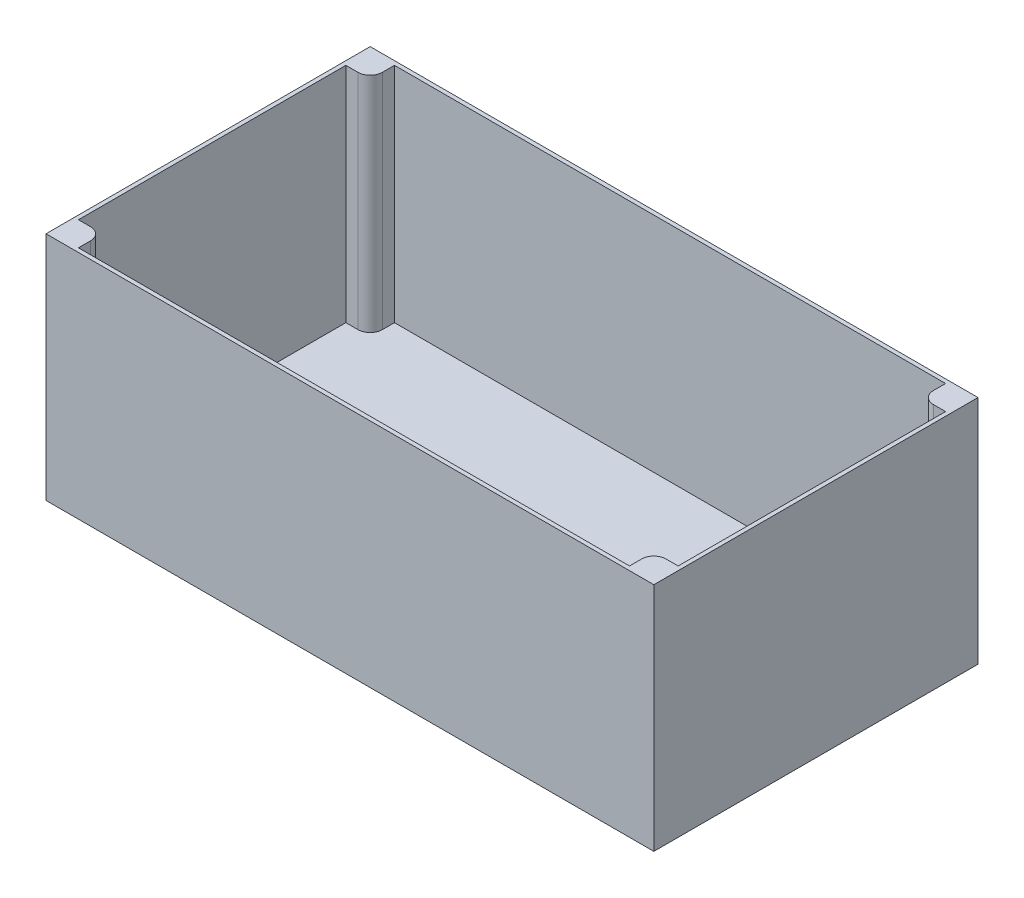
ISO-10303-21;
HEADER;
FILE_DESCRIPTION(('STEP AP214'),'2;1');
FILE_NAME('part.step','',(''),(''),'','','');
FILE_SCHEMA(('AUTOMOTIVE_DESIGN { 1 0 10303 214 1 1 1 1 }'));
ENDSEC;
DATA;
#1=APPLICATION_CONTEXT('core data for automotive mechanical design processes');
#2=APPLICATION_PROTOCOL_DEFINITION('international standard','automotive_design',2000,#1);
#3=PRODUCT_CONTEXT('',#1,'mechanical');
#4=PRODUCT('Part','Part','',(#3));
#5=PRODUCT_RELATED_PRODUCT_CATEGORY('part','',(#4));
#6=PRODUCT_DEFINITION_FORMATION('','',#4);
#7=PRODUCT_DEFINITION_CONTEXT('part definition',#1,'design');
#8=PRODUCT_DEFINITION('design','',#6,#7);
#9=PRODUCT_DEFINITION_SHAPE('','',#8);
#10=(LENGTH_UNIT() NAMED_UNIT(*) SI_UNIT(.MILLI.,.METRE.));
#11=(NAMED_UNIT(*) PLANE_ANGLE_UNIT() SI_UNIT($,.RADIAN.));
#12=(NAMED_UNIT(*) SI_UNIT($,.STERADIAN.) SOLID_ANGLE_UNIT());
#13=UNCERTAINTY_MEASURE_WITH_UNIT(LENGTH_MEASURE(1.E-05),#10,'distance_accuracy_value','');
#14=(GEOMETRIC_REPRESENTATION_CONTEXT(3) GLOBAL_UNCERTAINTY_ASSIGNED_CONTEXT((#13)) GLOBAL_UNIT_ASSIGNED_CONTEXT((#10,
#11,#12)) REPRESENTATION_CONTEXT('',''));
#15=CARTESIAN_POINT('',(0.,0.,0.));
#16=DIRECTION('',(0.,0.,1.));
#17=DIRECTION('',(1.,0.,0.));
#18=AXIS2_PLACEMENT_3D('',#15,#16,#17);
#19=CARTESIAN_POINT('',(0.,2.,0.));
#20=DIRECTION('',(0.,-1.,0.));
#21=DIRECTION('',(0.,0.,-1.));
#22=AXIS2_PLACEMENT_3D('',#19,#20,#21);
#23=PLANE('',#22);
#24=DIRECTION('',(-1.,0.,0.));
#25=VECTOR('',#24,1.);
#26=CARTESIAN_POINT('',(68.,2.,33.));
#27=LINE('',#26,#25);
#28=CARTESIAN_POINT('',(74.,2.,33.));
#29=VERTEX_POINT('',#28);
#30=CARTESIAN_POINT('',(71.,2.,33.));
#31=VERTEX_POINT('',#30);
#32=EDGE_CURVE('E581',#29,#31,#27,.T.);
#33=ORIENTED_EDGE('',*,*,#32,.F.);
#34=DIRECTION('',(0.,0.,-1.));
#35=VECTOR('',#34,1.);
#36=CARTESIAN_POINT('',(74.,2.,39.));
#37=LINE('',#36,#35);
#38=CARTESIAN_POINT('',(74.,2.,-33.));
#39=VERTEX_POINT('',#38);
#40=EDGE_CURVE('E214',#29,#39,#37,.T.);
#41=ORIENTED_EDGE('',*,*,#40,.T.);
#42=DIRECTION('',(1.,0.,0.));
#43=VECTOR('',#42,1.);
#44=CARTESIAN_POINT('',(74.,2.,-33.));
#45=LINE('',#44,#43);
#46=CARTESIAN_POINT('',(71.,2.,-33.));
#47=VERTEX_POINT('',#46);
#48=EDGE_CURVE('E302',#47,#39,#45,.T.);
#49=ORIENTED_EDGE('',*,*,#48,.F.);
#50=CARTESIAN_POINT('',(71.,2.,-36.));
#51=DIRECTION('',(0.,-1.,0.));
#52=DIRECTION('',(0.,0.,-1.));
#53=AXIS2_PLACEMENT_3D('',#50,#51,#52);
#54=CIRCLE('',#53,3.);
#55=CARTESIAN_POINT('',(68.,2.,-36.));
#56=VERTEX_POINT('',#55);
#57=EDGE_CURVE('E43',#47,#56,#54,.T.);
#58=ORIENTED_EDGE('',*,*,#57,.T.);
#59=DIRECTION('',(0.,0.,1.));
#60=VECTOR('',#59,1.);
#61=CARTESIAN_POINT('',(68.,2.,-39.));
#62=LINE('',#61,#60);
#63=CARTESIAN_POINT('',(68.,2.,-39.));
#64=VERTEX_POINT('',#63);
#65=EDGE_CURVE('E300',#64,#56,#62,.T.);
#66=ORIENTED_EDGE('',*,*,#65,.F.);
#67=DIRECTION('',(-1.,0.,0.));
#68=VECTOR('',#67,1.);
#69=CARTESIAN_POINT('',(-74.,2.,-39.));
#70=LINE('',#69,#68);
#71=CARTESIAN_POINT('',(-68.,2.,-39.));
#72=VERTEX_POINT('',#71);
#73=EDGE_CURVE('E230',#64,#72,#70,.T.);
#74=ORIENTED_EDGE('',*,*,#73,.T.);
#75=DIRECTION('',(0.,0.,-1.));
#76=VECTOR('',#75,1.);
#77=CARTESIAN_POINT('',(-68.,2.,-39.));
#78=LINE('',#77,#76);
#79=CARTESIAN_POINT('',(-68.,2.,-36.));
#80=VERTEX_POINT('',#79);
#81=EDGE_CURVE('E216',#80,#72,#78,.T.);
#82=ORIENTED_EDGE('',*,*,#81,.F.);
#83=CARTESIAN_POINT('',(-71.,2.,-36.));
#84=DIRECTION('',(0.,-1.,0.));
#85=DIRECTION('',(0.,0.,-1.));
#86=AXIS2_PLACEMENT_3D('',#83,#84,#85);
#87=CIRCLE('',#86,3.);
#88=CARTESIAN_POINT('',(-71.,2.,-33.));
#89=VERTEX_POINT('',#88);
#90=EDGE_CURVE('E11',#80,#89,#87,.T.);
#91=ORIENTED_EDGE('',*,*,#90,.T.);
#92=DIRECTION('',(1.,0.,0.));
#93=VECTOR('',#92,1.);
#94=CARTESIAN_POINT('',(-74.,2.,-33.));
#95=LINE('',#94,#93);
#96=CARTESIAN_POINT('',(-74.,2.,-33.));
#97=VERTEX_POINT('',#96);
#98=EDGE_CURVE('E180',#97,#89,#95,.T.);
#99=ORIENTED_EDGE('',*,*,#98,.F.);
#100=DIRECTION('',(0.,0.,1.));
#101=VECTOR('',#100,1.);
#102=CARTESIAN_POINT('',(-74.,2.,39.));
#103=LINE('',#102,#101);
#104=CARTESIAN_POINT('',(-74.,2.,33.));
#105=VERTEX_POINT('',#104);
#106=EDGE_CURVE('E233',#97,#105,#103,.T.);
#107=ORIENTED_EDGE('',*,*,#106,.T.);
#108=DIRECTION('',(-1.,0.,0.));
#109=VECTOR('',#108,1.);
#110=CARTESIAN_POINT('',(-74.,2.,33.));
#111=LINE('',#110,#109);
#112=CARTESIAN_POINT('',(-71.,2.,33.));
#113=VERTEX_POINT('',#112);
#114=EDGE_CURVE('E204',#113,#105,#111,.T.);
#115=ORIENTED_EDGE('',*,*,#114,.F.);
#116=CARTESIAN_POINT('',(-71.,2.,36.));
#117=DIRECTION('',(0.,-1.,0.));
#118=DIRECTION('',(0.,0.,-1.));
#119=AXIS2_PLACEMENT_3D('',#116,#117,#118);
#120=CIRCLE('',#119,3.);
#121=CARTESIAN_POINT('',(-68.,2.,36.));
#122=VERTEX_POINT('',#121);
#123=EDGE_CURVE('E295',#113,#122,#120,.T.);
#124=ORIENTED_EDGE('',*,*,#123,.T.);
#125=DIRECTION('',(0.,0.,-1.));
#126=VECTOR('',#125,1.);
#127=CARTESIAN_POINT('',(-68.,2.,39.));
#128=LINE('',#127,#126);
#129=CARTESIAN_POINT('',(-68.,2.,39.));
#130=VERTEX_POINT('',#129);
#131=EDGE_CURVE('E327',#130,#122,#128,.T.);
#132=ORIENTED_EDGE('',*,*,#131,.F.);
#133=DIRECTION('',(1.,0.,0.));
#134=VECTOR('',#133,1.);
#135=CARTESIAN_POINT('',(-74.,2.,39.));
#136=LINE('',#135,#134);
#137=CARTESIAN_POINT('',(68.,2.,39.));
#138=VERTEX_POINT('',#137);
#139=EDGE_CURVE('E198',#130,#138,#136,.T.);
#140=ORIENTED_EDGE('',*,*,#139,.T.);
#141=DIRECTION('',(0.,0.,1.));
#142=VECTOR('',#141,1.);
#143=CARTESIAN_POINT('',(68.,2.,39.));
#144=LINE('',#143,#142);
#145=CARTESIAN_POINT('',(68.,2.,36.));
#146=VERTEX_POINT('',#145);
#147=EDGE_CURVE('E587',#146,#138,#144,.T.);
#148=ORIENTED_EDGE('',*,*,#147,.F.);
#149=CARTESIAN_POINT('',(71.,2.,36.));
#150=DIRECTION('',(0.,-1.,0.));
#151=DIRECTION('',(0.,0.,-1.));
#152=AXIS2_PLACEMENT_3D('',#149,#150,#151);
#153=CIRCLE('',#152,3.);
#154=EDGE_CURVE('E297',#146,#31,#153,.T.);
#155=ORIENTED_EDGE('',*,*,#154,.T.);
#156=EDGE_LOOP('',(#33,#41,#49,#58,#66,#74,#82,#91,#99,#107,#115,#124,#132,#140,#148,#155));
#157=FACE_BOUND('',#156,.T.);
#158=ADVANCED_FACE('F35',(#157),#23,.F.);
#159=CARTESIAN_POINT('',(74.,57.,39.));
#160=DIRECTION('',(-1.,0.,0.));
#161=DIRECTION('',(0.,0.,1.));
#162=AXIS2_PLACEMENT_3D('',#159,#160,#161);
#163=PLANE('',#162);
#164=ORIENTED_EDGE('',*,*,#40,.F.);
#165=DIRECTION('',(0.,-1.,0.));
#166=VECTOR('',#165,1.);
#167=CARTESIAN_POINT('',(74.,65.4852813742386,33.));
#168=LINE('',#167,#166);
#169=CARTESIAN_POINT('',(74.,57.,33.));
#170=VERTEX_POINT('',#169);
#171=EDGE_CURVE('E585',#170,#29,#168,.T.);
#172=ORIENTED_EDGE('',*,*,#171,.F.);
#173=DIRECTION('',(0.,0.,-1.));
#174=VECTOR('',#173,1.);
#175=CARTESIAN_POINT('',(74.,57.,39.));
#176=LINE('',#175,#174);
#177=CARTESIAN_POINT('',(74.,57.,-33.));
#178=VERTEX_POINT('',#177);
#179=EDGE_CURVE('E223',#170,#178,#176,.T.);
#180=ORIENTED_EDGE('',*,*,#179,.T.);
#181=DIRECTION('',(0.,-1.,0.));
#182=VECTOR('',#181,1.);
#183=CARTESIAN_POINT('',(74.,65.4852813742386,-33.));
#184=LINE('',#183,#182);
#185=EDGE_CURVE('E325',#178,#39,#184,.T.);
#186=ORIENTED_EDGE('',*,*,#185,.T.);
#187=EDGE_LOOP('',(#164,#172,#180,#186));
#188=FACE_BOUND('',#187,.T.);
#189=ADVANCED_FACE('F361',(#188),#163,.T.);
#190=CARTESIAN_POINT('',(-74.,57.,39.));
#191=DIRECTION('',(0.,0.,-1.));
#192=DIRECTION('',(-1.,0.,0.));
#193=AXIS2_PLACEMENT_3D('',#190,#191,#192);
#194=PLANE('',#193);
#195=DIRECTION('',(1.,0.,0.));
#196=VECTOR('',#195,1.);
#197=CARTESIAN_POINT('',(-74.,57.,39.));
#198=LINE('',#197,#196);
#199=CARTESIAN_POINT('',(-68.,57.,39.));
#200=VERTEX_POINT('',#199);
#201=CARTESIAN_POINT('',(68.,57.,39.));
#202=VERTEX_POINT('',#201);
#203=EDGE_CURVE('E184',#200,#202,#198,.T.);
#204=ORIENTED_EDGE('',*,*,#203,.T.);
#205=DIRECTION('',(0.,-1.,0.));
#206=VECTOR('',#205,1.);
#207=CARTESIAN_POINT('',(68.,65.4852813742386,39.));
#208=LINE('',#207,#206);
#209=EDGE_CURVE('E593',#202,#138,#208,.T.);
#210=ORIENTED_EDGE('',*,*,#209,.T.);
#211=ORIENTED_EDGE('',*,*,#139,.F.);
#212=DIRECTION('',(0.,-1.,0.));
#213=VECTOR('',#212,1.);
#214=CARTESIAN_POINT('',(-68.,65.4852813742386,39.));
#215=LINE('',#214,#213);
#216=EDGE_CURVE('E175',#200,#130,#215,.T.);
#217=ORIENTED_EDGE('',*,*,#216,.F.);
#218=EDGE_LOOP('',(#204,#210,#211,#217));
#219=FACE_BOUND('',#218,.T.);
#220=ADVANCED_FACE('F196',(#219),#194,.T.);
#221=CARTESIAN_POINT('',(-74.,57.,-39.));
#222=DIRECTION('',(0.,0.,1.));
#223=DIRECTION('',(1.,0.,0.));
#224=AXIS2_PLACEMENT_3D('',#221,#222,#223);
#225=PLANE('',#224);
#226=ORIENTED_EDGE('',*,*,#73,.F.);
#227=DIRECTION('',(0.,-1.,0.));
#228=VECTOR('',#227,1.);
#229=CARTESIAN_POINT('',(68.,65.4852813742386,-39.));
#230=LINE('',#229,#228);
#231=CARTESIAN_POINT('',(68.,57.,-39.));
#232=VERTEX_POINT('',#231);
#233=EDGE_CURVE('E311',#232,#64,#230,.T.);
#234=ORIENTED_EDGE('',*,*,#233,.F.);
#235=DIRECTION('',(-1.,0.,0.));
#236=VECTOR('',#235,1.);
#237=CARTESIAN_POINT('',(-74.,57.,-39.));
#238=LINE('',#237,#236);
#239=CARTESIAN_POINT('',(-68.,57.,-39.));
#240=VERTEX_POINT('',#239);
#241=EDGE_CURVE('E225',#232,#240,#238,.T.);
#242=ORIENTED_EDGE('',*,*,#241,.T.);
#243=DIRECTION('',(0.,-1.,0.));
#244=VECTOR('',#243,1.);
#245=CARTESIAN_POINT('',(-68.,65.4852813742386,-39.));
#246=LINE('',#245,#244);
#247=EDGE_CURVE('E218',#240,#72,#246,.T.);
#248=ORIENTED_EDGE('',*,*,#247,.T.);
#249=EDGE_LOOP('',(#226,#234,#242,#248));
#250=FACE_BOUND('',#249,.T.);
#251=ADVANCED_FACE('F352',(#250),#225,.T.);
#252=CARTESIAN_POINT('',(-74.,57.,39.));
#253=DIRECTION('',(1.,0.,0.));
#254=DIRECTION('',(0.,0.,-1.));
#255=AXIS2_PLACEMENT_3D('',#252,#253,#254);
#256=PLANE('',#255);
#257=DIRECTION('',(0.,0.,1.));
#258=VECTOR('',#257,1.);
#259=CARTESIAN_POINT('',(-74.,57.,39.));
#260=LINE('',#259,#258);
#261=CARTESIAN_POINT('',(-74.,57.,-33.));
#262=VERTEX_POINT('',#261);
#263=CARTESIAN_POINT('',(-74.,57.,33.));
#264=VERTEX_POINT('',#263);
#265=EDGE_CURVE('E193',#262,#264,#260,.T.);
#266=ORIENTED_EDGE('',*,*,#265,.T.);
#267=DIRECTION('',(0.,-1.,0.));
#268=VECTOR('',#267,1.);
#269=CARTESIAN_POINT('',(-74.,65.4852813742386,33.));
#270=LINE('',#269,#268);
#271=EDGE_CURVE('E199',#264,#105,#270,.T.);
#272=ORIENTED_EDGE('',*,*,#271,.T.);
#273=ORIENTED_EDGE('',*,*,#106,.F.);
#274=DIRECTION('',(0.,-1.,0.));
#275=VECTOR('',#274,1.);
#276=CARTESIAN_POINT('',(-74.,65.4852813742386,-33.));
#277=LINE('',#276,#275);
#278=EDGE_CURVE('E212',#262,#97,#277,.T.);
#279=ORIENTED_EDGE('',*,*,#278,.F.);
#280=EDGE_LOOP('',(#266,#272,#273,#279));
#281=FACE_BOUND('',#280,.T.);
#282=ADVANCED_FACE('F339',(#281),#256,.T.);
#283=CARTESIAN_POINT('',(75.,2.,40.));
#284=DIRECTION('',(-1.,0.,0.));
#285=DIRECTION('',(0.,0.,1.));
#286=AXIS2_PLACEMENT_3D('',#283,#284,#285);
#287=PLANE('',#286);
#288=DIRECTION('',(0.,0.,-1.));
#289=VECTOR('',#288,1.);
#290=CARTESIAN_POINT('',(75.,0.,40.));
#291=LINE('',#290,#289);
#292=CARTESIAN_POINT('',(75.,0.,40.));
#293=VERTEX_POINT('',#292);
#294=CARTESIAN_POINT('',(75.,0.,-40.));
#295=VERTEX_POINT('',#294);
#296=EDGE_CURVE('E248',#293,#295,#291,.T.);
#297=ORIENTED_EDGE('',*,*,#296,.T.);
#298=DIRECTION('',(0.,-1.,0.));
#299=VECTOR('',#298,1.);
#300=CARTESIAN_POINT('',(75.,2.,-40.));
#301=LINE('',#300,#299);
#302=CARTESIAN_POINT('',(75.,57.,-40.));
#303=VERTEX_POINT('',#302);
#304=EDGE_CURVE('E266',#303,#295,#301,.T.);
#305=ORIENTED_EDGE('',*,*,#304,.F.);
#306=DIRECTION('',(0.,0.,-1.));
#307=VECTOR('',#306,1.);
#308=CARTESIAN_POINT('',(75.,57.,40.));
#309=LINE('',#308,#307);
#310=CARTESIAN_POINT('',(75.,57.,40.));
#311=VERTEX_POINT('',#310);
#312=EDGE_CURVE('E192',#311,#303,#309,.T.);
#313=ORIENTED_EDGE('',*,*,#312,.F.);
#314=DIRECTION('',(0.,-1.,0.));
#315=VECTOR('',#314,1.);
#316=CARTESIAN_POINT('',(75.,2.,40.));
#317=LINE('',#316,#315);
#318=EDGE_CURVE('E257',#311,#293,#317,.T.);
#319=ORIENTED_EDGE('',*,*,#318,.T.);
#320=EDGE_LOOP('',(#297,#305,#313,#319));
#321=FACE_BOUND('',#320,.T.);
#322=ADVANCED_FACE('F359',(#321),#287,.F.);
#323=CARTESIAN_POINT('',(-75.,2.,-40.));
#324=DIRECTION('',(0.,0.,1.));
#325=DIRECTION('',(1.,0.,0.));
#326=AXIS2_PLACEMENT_3D('',#323,#324,#325);
#327=PLANE('',#326);
#328=DIRECTION('',(-1.,0.,0.));
#329=VECTOR('',#328,1.);
#330=CARTESIAN_POINT('',(-75.,0.,-40.));
#331=LINE('',#330,#329);
#332=CARTESIAN_POINT('',(-75.,0.,-40.));
#333=VERTEX_POINT('',#332);
#334=EDGE_CURVE('E251',#295,#333,#331,.T.);
#335=ORIENTED_EDGE('',*,*,#334,.T.);
#336=DIRECTION('',(0.,-1.,0.));
#337=VECTOR('',#336,1.);
#338=CARTESIAN_POINT('',(-75.,2.,-40.));
#339=LINE('',#338,#337);
#340=CARTESIAN_POINT('',(-75.,57.,-40.));
#341=VERTEX_POINT('',#340);
#342=EDGE_CURVE('E263',#341,#333,#339,.T.);
#343=ORIENTED_EDGE('',*,*,#342,.F.);
#344=DIRECTION('',(-1.,0.,0.));
#345=VECTOR('',#344,1.);
#346=CARTESIAN_POINT('',(-75.,57.,-40.));
#347=LINE('',#346,#345);
#348=EDGE_CURVE('E239',#303,#341,#347,.T.);
#349=ORIENTED_EDGE('',*,*,#348,.F.);
#350=ORIENTED_EDGE('',*,*,#304,.T.);
#351=EDGE_LOOP('',(#335,#343,#349,#350));
#352=FACE_BOUND('',#351,.T.);
#353=ADVANCED_FACE('F384',(#352),#327,.F.);
#354=CARTESIAN_POINT('',(-75.,2.,40.));
#355=DIRECTION('',(1.,0.,0.));
#356=DIRECTION('',(0.,0.,-1.));
#357=AXIS2_PLACEMENT_3D('',#354,#355,#356);
#358=PLANE('',#357);
#359=DIRECTION('',(0.,0.,1.));
#360=VECTOR('',#359,1.);
#361=CARTESIAN_POINT('',(-75.,0.,40.));
#362=LINE('',#361,#360);
#363=CARTESIAN_POINT('',(-75.,0.,40.));
#364=VERTEX_POINT('',#363);
#365=EDGE_CURVE('E253',#333,#364,#362,.T.);
#366=ORIENTED_EDGE('',*,*,#365,.T.);
#367=DIRECTION('',(0.,-1.,0.));
#368=VECTOR('',#367,1.);
#369=CARTESIAN_POINT('',(-75.,2.,40.));
#370=LINE('',#369,#368);
#371=CARTESIAN_POINT('',(-75.,57.,40.));
#372=VERTEX_POINT('',#371);
#373=EDGE_CURVE('E260',#372,#364,#370,.T.);
#374=ORIENTED_EDGE('',*,*,#373,.F.);
#375=DIRECTION('',(0.,0.,1.));
#376=VECTOR('',#375,1.);
#377=CARTESIAN_POINT('',(-75.,57.,40.));
#378=LINE('',#377,#376);
#379=EDGE_CURVE('E242',#341,#372,#378,.T.);
#380=ORIENTED_EDGE('',*,*,#379,.F.);
#381=ORIENTED_EDGE('',*,*,#342,.T.);
#382=EDGE_LOOP('',(#366,#374,#380,#381));
#383=FACE_BOUND('',#382,.T.);
#384=ADVANCED_FACE('F380',(#383),#358,.F.);
#385=CARTESIAN_POINT('',(-75.,2.,40.));
#386=DIRECTION('',(0.,0.,-1.));
#387=DIRECTION('',(-1.,0.,0.));
#388=AXIS2_PLACEMENT_3D('',#385,#386,#387);
#389=PLANE('',#388);
#390=DIRECTION('',(1.,0.,0.));
#391=VECTOR('',#390,1.);
#392=CARTESIAN_POINT('',(-75.,0.,40.));
#393=LINE('',#392,#391);
#394=EDGE_CURVE('E255',#364,#293,#393,.T.);
#395=ORIENTED_EDGE('',*,*,#394,.T.);
#396=ORIENTED_EDGE('',*,*,#318,.F.);
#397=DIRECTION('',(1.,0.,0.));
#398=VECTOR('',#397,1.);
#399=CARTESIAN_POINT('',(-75.,57.,40.));
#400=LINE('',#399,#398);
#401=EDGE_CURVE('E245',#372,#311,#400,.T.);
#402=ORIENTED_EDGE('',*,*,#401,.F.);
#403=ORIENTED_EDGE('',*,*,#373,.T.);
#404=EDGE_LOOP('',(#395,#396,#402,#403));
#405=FACE_BOUND('',#404,.T.);
#406=ADVANCED_FACE('F376',(#405),#389,.F.);
#407=CARTESIAN_POINT('',(0.,0.,0.));
#408=DIRECTION('',(0.,-1.,0.));
#409=DIRECTION('',(0.,0.,-1.));
#410=AXIS2_PLACEMENT_3D('',#407,#408,#409);
#411=PLANE('',#410);
#412=ORIENTED_EDGE('',*,*,#296,.F.);
#413=ORIENTED_EDGE('',*,*,#394,.F.);
#414=ORIENTED_EDGE('',*,*,#365,.F.);
#415=ORIENTED_EDGE('',*,*,#334,.F.);
#416=EDGE_LOOP('',(#412,#413,#414,#415));
#417=FACE_BOUND('',#416,.T.);
#418=ADVANCED_FACE('F373',(#417),#411,.T.);
#419=CARTESIAN_POINT('',(0.,57.,0.));
#420=DIRECTION('',(0.,-1.,0.));
#421=DIRECTION('',(0.,0.,-1.));
#422=AXIS2_PLACEMENT_3D('',#419,#420,#421);
#423=PLANE('',#422);
#424=DIRECTION('',(0.,0.,1.));
#425=VECTOR('',#424,1.);
#426=CARTESIAN_POINT('',(-68.,57.,39.));
#427=LINE('',#426,#425);
#428=CARTESIAN_POINT('',(-68.,57.,36.));
#429=VERTEX_POINT('',#428);
#430=EDGE_CURVE('E170',#429,#200,#427,.T.);
#431=ORIENTED_EDGE('',*,*,#430,.F.);
#432=CARTESIAN_POINT('',(-71.,57.,36.));
#433=DIRECTION('',(0.,-1.,0.));
#434=DIRECTION('',(0.,0.,-1.));
#435=AXIS2_PLACEMENT_3D('',#432,#433,#434);
#436=CIRCLE('',#435,3.);
#437=CARTESIAN_POINT('',(-71.,57.,33.));
#438=VERTEX_POINT('',#437);
#439=EDGE_CURVE('E279',#429,#438,#436,.F.);
#440=ORIENTED_EDGE('',*,*,#439,.T.);
#441=DIRECTION('',(1.,0.,0.));
#442=VECTOR('',#441,1.);
#443=CARTESIAN_POINT('',(-74.,57.,33.));
#444=LINE('',#443,#442);
#445=EDGE_CURVE('E181',#264,#438,#444,.T.);
#446=ORIENTED_EDGE('',*,*,#445,.F.);
#447=ORIENTED_EDGE('',*,*,#265,.F.);
#448=DIRECTION('',(-1.,0.,0.));
#449=VECTOR('',#448,1.);
#450=CARTESIAN_POINT('',(-74.,57.,-33.));
#451=LINE('',#450,#449);
#452=CARTESIAN_POINT('',(-71.,57.,-33.));
#453=VERTEX_POINT('',#452);
#454=EDGE_CURVE('E211',#453,#262,#451,.T.);
#455=ORIENTED_EDGE('',*,*,#454,.F.);
#456=CARTESIAN_POINT('',(-71.,57.,-36.));
#457=DIRECTION('',(0.,-1.,0.));
#458=DIRECTION('',(0.,0.,-1.));
#459=AXIS2_PLACEMENT_3D('',#456,#457,#458);
#460=CIRCLE('',#459,3.);
#461=CARTESIAN_POINT('',(-68.,57.,-36.));
#462=VERTEX_POINT('',#461);
#463=EDGE_CURVE('E273',#453,#462,#460,.F.);
#464=ORIENTED_EDGE('',*,*,#463,.T.);
#465=DIRECTION('',(0.,0.,1.));
#466=VECTOR('',#465,1.);
#467=CARTESIAN_POINT('',(-68.,57.,-39.));
#468=LINE('',#467,#466);
#469=EDGE_CURVE('E208',#240,#462,#468,.T.);
#470=ORIENTED_EDGE('',*,*,#469,.F.);
#471=ORIENTED_EDGE('',*,*,#241,.F.);
#472=DIRECTION('',(0.,0.,-1.));
#473=VECTOR('',#472,1.);
#474=CARTESIAN_POINT('',(68.,57.,-39.));
#475=LINE('',#474,#473);
#476=CARTESIAN_POINT('',(68.,57.,-36.));
#477=VERTEX_POINT('',#476);
#478=EDGE_CURVE('E321',#477,#232,#475,.T.);
#479=ORIENTED_EDGE('',*,*,#478,.F.);
#480=CARTESIAN_POINT('',(71.,57.,-36.));
#481=DIRECTION('',(0.,-1.,0.));
#482=DIRECTION('',(0.,0.,-1.));
#483=AXIS2_PLACEMENT_3D('',#480,#481,#482);
#484=CIRCLE('',#483,3.);
#485=CARTESIAN_POINT('',(71.,57.,-33.));
#486=VERTEX_POINT('',#485);
#487=EDGE_CURVE('E275',#477,#486,#484,.F.);
#488=ORIENTED_EDGE('',*,*,#487,.T.);
#489=DIRECTION('',(-1.,0.,0.));
#490=VECTOR('',#489,1.);
#491=CARTESIAN_POINT('',(74.,57.,-33.));
#492=LINE('',#491,#490);
#493=EDGE_CURVE('E318',#178,#486,#492,.T.);
#494=ORIENTED_EDGE('',*,*,#493,.F.);
#495=ORIENTED_EDGE('',*,*,#179,.F.);
#496=DIRECTION('',(1.,0.,0.));
#497=VECTOR('',#496,1.);
#498=CARTESIAN_POINT('',(68.,57.,33.));
#499=LINE('',#498,#497);
#500=CARTESIAN_POINT('',(71.,57.,33.));
#501=VERTEX_POINT('',#500);
#502=EDGE_CURVE('E591',#501,#170,#499,.T.);
#503=ORIENTED_EDGE('',*,*,#502,.F.);
#504=CARTESIAN_POINT('',(71.,57.,36.));
#505=DIRECTION('',(0.,-1.,0.));
#506=DIRECTION('',(0.,0.,-1.));
#507=AXIS2_PLACEMENT_3D('',#504,#505,#506);
#508=CIRCLE('',#507,3.);
#509=CARTESIAN_POINT('',(68.,57.,36.));
#510=VERTEX_POINT('',#509);
#511=EDGE_CURVE('E277',#501,#510,#508,.F.);
#512=ORIENTED_EDGE('',*,*,#511,.T.);
#513=DIRECTION('',(0.,0.,-1.));
#514=VECTOR('',#513,1.);
#515=CARTESIAN_POINT('',(68.,57.,39.));
#516=LINE('',#515,#514);
#517=EDGE_CURVE('E188',#202,#510,#516,.T.);
#518=ORIENTED_EDGE('',*,*,#517,.F.);
#519=ORIENTED_EDGE('',*,*,#203,.F.);
#520=EDGE_LOOP('',(#431,#440,#446,#447,#455,#464,#470,#471,#479,#488,#494,#495,#503,#512,#518,#519));
#521=FACE_BOUND('',#520,.T.);
#522=ORIENTED_EDGE('',*,*,#312,.T.);
#523=ORIENTED_EDGE('',*,*,#348,.T.);
#524=ORIENTED_EDGE('',*,*,#379,.T.);
#525=ORIENTED_EDGE('',*,*,#401,.T.);
#526=EDGE_LOOP('',(#522,#523,#524,#525));
#527=FACE_BOUND('',#526,.T.);
#528=ADVANCED_FACE('F185',(#521,#527),#423,.F.);
#529=CARTESIAN_POINT('',(-68.,65.4852813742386,-39.));
#530=DIRECTION('',(-1.,0.,0.));
#531=DIRECTION('',(0.,0.,1.));
#532=AXIS2_PLACEMENT_3D('',#529,#530,#531);
#533=PLANE('',#532);
#534=ORIENTED_EDGE('',*,*,#469,.T.);
#535=DIRECTION('',(0.,-1.,0.));
#536=VECTOR('',#535,1.);
#537=CARTESIAN_POINT('',(-68.,65.4852813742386,-36.));
#538=LINE('',#537,#536);
#539=EDGE_CURVE('E291',#462,#80,#538,.T.);
#540=ORIENTED_EDGE('',*,*,#539,.T.);
#541=ORIENTED_EDGE('',*,*,#81,.T.);
#542=ORIENTED_EDGE('',*,*,#247,.F.);
#543=EDGE_LOOP('',(#534,#540,#541,#542));
#544=FACE_BOUND('',#543,.T.);
#545=ADVANCED_FACE('F350',(#544),#533,.F.);
#546=CARTESIAN_POINT('',(-74.,65.4852813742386,-33.));
#547=DIRECTION('',(0.,0.,-1.));
#548=DIRECTION('',(-1.,0.,0.));
#549=AXIS2_PLACEMENT_3D('',#546,#547,#548);
#550=PLANE('',#549);
#551=ORIENTED_EDGE('',*,*,#98,.T.);
#552=DIRECTION('',(0.,-1.,0.));
#553=VECTOR('',#552,1.);
#554=CARTESIAN_POINT('',(-71.,65.4852813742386,-33.));
#555=LINE('',#554,#553);
#556=EDGE_CURVE('E293',#89,#453,#555,.F.);
#557=ORIENTED_EDGE('',*,*,#556,.T.);
#558=ORIENTED_EDGE('',*,*,#454,.T.);
#559=ORIENTED_EDGE('',*,*,#278,.T.);
#560=EDGE_LOOP('',(#551,#557,#558,#559));
#561=FACE_BOUND('',#560,.T.);
#562=ADVANCED_FACE('F344',(#561),#550,.F.);
#563=CARTESIAN_POINT('',(-74.,65.4852813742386,33.));
#564=DIRECTION('',(0.,0.,1.));
#565=DIRECTION('',(1.,0.,0.));
#566=AXIS2_PLACEMENT_3D('',#563,#564,#565);
#567=PLANE('',#566);
#568=ORIENTED_EDGE('',*,*,#445,.T.);
#569=DIRECTION('',(0.,-1.,0.));
#570=VECTOR('',#569,1.);
#571=CARTESIAN_POINT('',(-71.,65.4852813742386,33.));
#572=LINE('',#571,#570);
#573=EDGE_CURVE('E269',#438,#113,#572,.T.);
#574=ORIENTED_EDGE('',*,*,#573,.T.);
#575=ORIENTED_EDGE('',*,*,#114,.T.);
#576=ORIENTED_EDGE('',*,*,#271,.F.);
#577=EDGE_LOOP('',(#568,#574,#575,#576));
#578=FACE_BOUND('',#577,.T.);
#579=ADVANCED_FACE('F335',(#578),#567,.F.);
#580=CARTESIAN_POINT('',(-68.,65.4852813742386,39.));
#581=DIRECTION('',(-1.,0.,0.));
#582=DIRECTION('',(0.,0.,1.));
#583=AXIS2_PLACEMENT_3D('',#580,#581,#582);
#584=PLANE('',#583);
#585=ORIENTED_EDGE('',*,*,#131,.T.);
#586=DIRECTION('',(0.,-1.,0.));
#587=VECTOR('',#586,1.);
#588=CARTESIAN_POINT('',(-68.,65.4852813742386,36.));
#589=LINE('',#588,#587);
#590=EDGE_CURVE('E177',#122,#429,#589,.F.);
#591=ORIENTED_EDGE('',*,*,#590,.T.);
#592=ORIENTED_EDGE('',*,*,#430,.T.);
#593=ORIENTED_EDGE('',*,*,#216,.T.);
#594=EDGE_LOOP('',(#585,#591,#592,#593));
#595=FACE_BOUND('',#594,.T.);
#596=ADVANCED_FACE('F173',(#595),#584,.F.);
#597=CARTESIAN_POINT('',(74.,65.4852813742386,-33.));
#598=DIRECTION('',(0.,0.,-1.));
#599=DIRECTION('',(-1.,0.,0.));
#600=AXIS2_PLACEMENT_3D('',#597,#598,#599);
#601=PLANE('',#600);
#602=ORIENTED_EDGE('',*,*,#493,.T.);
#603=DIRECTION('',(0.,-1.,0.));
#604=VECTOR('',#603,1.);
#605=CARTESIAN_POINT('',(71.,65.4852813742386,-33.));
#606=LINE('',#605,#604);
#607=EDGE_CURVE('E286',#486,#47,#606,.T.);
#608=ORIENTED_EDGE('',*,*,#607,.T.);
#609=ORIENTED_EDGE('',*,*,#48,.T.);
#610=ORIENTED_EDGE('',*,*,#185,.F.);
#611=EDGE_LOOP('',(#602,#608,#609,#610));
#612=FACE_BOUND('',#611,.T.);
#613=ADVANCED_FACE('F323',(#612),#601,.F.);
#614=CARTESIAN_POINT('',(68.,65.4852813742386,-39.));
#615=DIRECTION('',(1.,0.,0.));
#616=DIRECTION('',(0.,0.,-1.));
#617=AXIS2_PLACEMENT_3D('',#614,#615,#616);
#618=PLANE('',#617);
#619=ORIENTED_EDGE('',*,*,#65,.T.);
#620=DIRECTION('',(0.,-1.,0.));
#621=VECTOR('',#620,1.);
#622=CARTESIAN_POINT('',(68.,65.4852813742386,-36.));
#623=LINE('',#622,#621);
#624=EDGE_CURVE('E289',#56,#477,#623,.F.);
#625=ORIENTED_EDGE('',*,*,#624,.T.);
#626=ORIENTED_EDGE('',*,*,#478,.T.);
#627=ORIENTED_EDGE('',*,*,#233,.T.);
#628=EDGE_LOOP('',(#619,#625,#626,#627));
#629=FACE_BOUND('',#628,.T.);
#630=ADVANCED_FACE('F308',(#629),#618,.F.);
#631=CARTESIAN_POINT('',(68.,65.4852813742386,33.));
#632=DIRECTION('',(0.,0.,1.));
#633=DIRECTION('',(1.,0.,0.));
#634=AXIS2_PLACEMENT_3D('',#631,#632,#633);
#635=PLANE('',#634);
#636=ORIENTED_EDGE('',*,*,#32,.T.);
#637=DIRECTION('',(0.,-1.,0.));
#638=VECTOR('',#637,1.);
#639=CARTESIAN_POINT('',(71.,65.4852813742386,33.));
#640=LINE('',#639,#638);
#641=EDGE_CURVE('E284',#31,#501,#640,.F.);
#642=ORIENTED_EDGE('',*,*,#641,.T.);
#643=ORIENTED_EDGE('',*,*,#502,.T.);
#644=ORIENTED_EDGE('',*,*,#171,.T.);
#645=EDGE_LOOP('',(#636,#642,#643,#644));
#646=FACE_BOUND('',#645,.T.);
#647=ADVANCED_FACE('F431',(#646),#635,.F.);
#648=CARTESIAN_POINT('',(68.,65.4852813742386,39.));
#649=DIRECTION('',(1.,0.,0.));
#650=DIRECTION('',(0.,0.,-1.));
#651=AXIS2_PLACEMENT_3D('',#648,#649,#650);
#652=PLANE('',#651);
#653=ORIENTED_EDGE('',*,*,#517,.T.);
#654=DIRECTION('',(0.,-1.,0.));
#655=VECTOR('',#654,1.);
#656=CARTESIAN_POINT('',(68.,65.4852813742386,36.));
#657=LINE('',#656,#655);
#658=EDGE_CURVE('E281',#510,#146,#657,.T.);
#659=ORIENTED_EDGE('',*,*,#658,.T.);
#660=ORIENTED_EDGE('',*,*,#147,.T.);
#661=ORIENTED_EDGE('',*,*,#209,.F.);
#662=EDGE_LOOP('',(#653,#659,#660,#661));
#663=FACE_BOUND('',#662,.T.);
#664=ADVANCED_FACE('F396',(#663),#652,.F.);
#665=CARTESIAN_POINT('',(-71.,65.4852813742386,36.));
#666=DIRECTION('',(0.,-1.,0.));
#667=DIRECTION('',(0.,0.,-1.));
#668=AXIS2_PLACEMENT_3D('',#665,#666,#667);
#669=CYLINDRICAL_SURFACE('',#668,3.);
#670=ORIENTED_EDGE('',*,*,#439,.F.);
#671=ORIENTED_EDGE('',*,*,#590,.F.);
#672=ORIENTED_EDGE('',*,*,#123,.F.);
#673=ORIENTED_EDGE('',*,*,#573,.F.);
#674=EDGE_LOOP('',(#670,#671,#672,#673));
#675=FACE_BOUND('',#674,.T.);
#676=ADVANCED_FACE('F392',(#675),#669,.T.);
#677=CARTESIAN_POINT('',(71.,65.4852813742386,36.));
#678=DIRECTION('',(0.,-1.,0.));
#679=DIRECTION('',(0.,0.,-1.));
#680=AXIS2_PLACEMENT_3D('',#677,#678,#679);
#681=CYLINDRICAL_SURFACE('',#680,3.);
#682=ORIENTED_EDGE('',*,*,#511,.F.);
#683=ORIENTED_EDGE('',*,*,#641,.F.);
#684=ORIENTED_EDGE('',*,*,#154,.F.);
#685=ORIENTED_EDGE('',*,*,#658,.F.);
#686=EDGE_LOOP('',(#682,#683,#684,#685));
#687=FACE_BOUND('',#686,.T.);
#688=ADVANCED_FACE('F395',(#687),#681,.T.);
#689=CARTESIAN_POINT('',(71.,65.4852813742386,-36.));
#690=DIRECTION('',(0.,-1.,0.));
#691=DIRECTION('',(0.,0.,-1.));
#692=AXIS2_PLACEMENT_3D('',#689,#690,#691);
#693=CYLINDRICAL_SURFACE('',#692,3.);
#694=ORIENTED_EDGE('',*,*,#487,.F.);
#695=ORIENTED_EDGE('',*,*,#624,.F.);
#696=ORIENTED_EDGE('',*,*,#57,.F.);
#697=ORIENTED_EDGE('',*,*,#607,.F.);
#698=EDGE_LOOP('',(#694,#695,#696,#697));
#699=FACE_BOUND('',#698,.T.);
#700=ADVANCED_FACE('F314',(#699),#693,.T.);
#701=CARTESIAN_POINT('',(-71.,65.4852813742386,-36.));
#702=DIRECTION('',(0.,-1.,0.));
#703=DIRECTION('',(0.,0.,-1.));
#704=AXIS2_PLACEMENT_3D('',#701,#702,#703);
#705=CYLINDRICAL_SURFACE('',#704,3.);
#706=ORIENTED_EDGE('',*,*,#463,.F.);
#707=ORIENTED_EDGE('',*,*,#556,.F.);
#708=ORIENTED_EDGE('',*,*,#90,.F.);
#709=ORIENTED_EDGE('',*,*,#539,.F.);
#710=EDGE_LOOP('',(#706,#707,#708,#709));
#711=FACE_BOUND('',#710,.T.);
#712=ADVANCED_FACE('F37',(#711),#705,.T.);
#713=CLOSED_SHELL('',(#158,#189,#220,#251,#282,#322,#353,#384,#406,#418,#528,#545,#562,#579,
#596,#613,#630,#647,#664,#676,#688,#700,#712));
#714=MANIFOLD_SOLID_BREP('B2',#713);
#715=ADVANCED_BREP_SHAPE_REPRESENTATION('',(#18,#714),#14);
#716=SHAPE_DEFINITION_REPRESENTATION(#9,#715);
ENDSEC;
END-ISO-10303-21;
